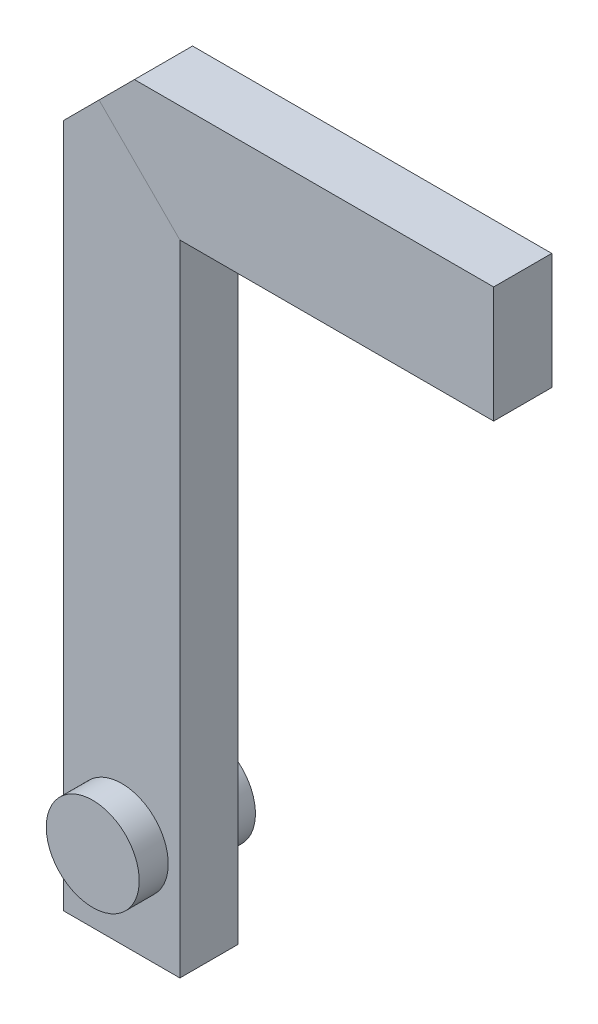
ISO-10303-21;
HEADER;
FILE_DESCRIPTION(('STEP AP214'),'2;1');
FILE_NAME('part.step','',(''),(''),'','','');
FILE_SCHEMA(('AUTOMOTIVE_DESIGN { 1 0 10303 214 1 1 1 1 }'));
ENDSEC;
DATA;
#1=APPLICATION_CONTEXT('core data for automotive mechanical design processes');
#2=APPLICATION_PROTOCOL_DEFINITION('international standard','automotive_design',2000,#1);
#3=PRODUCT_CONTEXT('',#1,'mechanical');
#4=PRODUCT('Part','Part','',(#3));
#5=PRODUCT_RELATED_PRODUCT_CATEGORY('part','',(#4));
#6=PRODUCT_DEFINITION_FORMATION('','',#4);
#7=PRODUCT_DEFINITION_CONTEXT('part definition',#1,'design');
#8=PRODUCT_DEFINITION('design','',#6,#7);
#9=PRODUCT_DEFINITION_SHAPE('','',#8);
#10=(LENGTH_UNIT() NAMED_UNIT(*) SI_UNIT(.MILLI.,.METRE.));
#11=(NAMED_UNIT(*) PLANE_ANGLE_UNIT() SI_UNIT($,.RADIAN.));
#12=(NAMED_UNIT(*) SI_UNIT($,.STERADIAN.) SOLID_ANGLE_UNIT());
#13=UNCERTAINTY_MEASURE_WITH_UNIT(LENGTH_MEASURE(1.E-05),#10,'distance_accuracy_value','');
#14=(GEOMETRIC_REPRESENTATION_CONTEXT(3) GLOBAL_UNCERTAINTY_ASSIGNED_CONTEXT((#13)) GLOBAL_UNIT_ASSIGNED_CONTEXT((#10,
#11,#12)) REPRESENTATION_CONTEXT('',''));
#15=CARTESIAN_POINT('',(0.,0.,0.));
#16=DIRECTION('',(0.,0.,1.));
#17=DIRECTION('',(1.,0.,0.));
#18=AXIS2_PLACEMENT_3D('',#15,#16,#17);
#19=CARTESIAN_POINT('',(20.32,0.,0.));
#20=DIRECTION('',(1.,0.,0.));
#21=DIRECTION('',(0.,0.,-1.));
#22=AXIS2_PLACEMENT_3D('',#19,#20,#21);
#23=PLANE('',#22);
#24=DIRECTION('',(0.,0.,1.));
#25=VECTOR('',#24,1.);
#26=CARTESIAN_POINT('',(20.32,41.275,-1.5875));
#27=LINE('',#26,#25);
#28=CARTESIAN_POINT('',(20.32,41.275,-1.5875));
#29=VERTEX_POINT('',#28);
#30=CARTESIAN_POINT('',(20.32,41.275,1.5875));
#31=VERTEX_POINT('',#30);
#32=EDGE_CURVE('E148',#29,#31,#27,.T.);
#33=ORIENTED_EDGE('',*,*,#32,.T.);
#34=DIRECTION('',(0.,-1.,0.));
#35=VECTOR('',#34,1.);
#36=CARTESIAN_POINT('',(20.32,34.925,1.5875));
#37=LINE('',#36,#35);
#38=CARTESIAN_POINT('',(20.32,34.925,1.5875));
#39=VERTEX_POINT('',#38);
#40=EDGE_CURVE('E145',#31,#39,#37,.T.);
#41=ORIENTED_EDGE('',*,*,#40,.T.);
#42=DIRECTION('',(0.,0.,-1.));
#43=VECTOR('',#42,1.);
#44=CARTESIAN_POINT('',(20.32,34.925,-1.5875));
#45=LINE('',#44,#43);
#46=CARTESIAN_POINT('',(20.32,34.925,-1.5875));
#47=VERTEX_POINT('',#46);
#48=EDGE_CURVE('E141',#39,#47,#45,.T.);
#49=ORIENTED_EDGE('',*,*,#48,.T.);
#50=DIRECTION('',(0.,1.,0.));
#51=VECTOR('',#50,1.);
#52=CARTESIAN_POINT('',(20.32,34.925,-1.5875));
#53=LINE('',#52,#51);
#54=EDGE_CURVE('E138',#47,#29,#53,.T.);
#55=ORIENTED_EDGE('',*,*,#54,.T.);
#56=EDGE_LOOP('',(#33,#41,#49,#55));
#57=FACE_BOUND('',#56,.T.);
#58=ADVANCED_FACE('F39',(#57),#23,.T.);
#59=CARTESIAN_POINT('',(38.1,0.,0.));
#60=DIRECTION('',(0.,1.,0.));
#61=DIRECTION('',(0.,0.,-1.));
#62=AXIS2_PLACEMENT_3D('',#59,#60,#61);
#63=PLANE('',#62);
#64=DIRECTION('',(0.,0.,1.));
#65=VECTOR('',#64,1.);
#66=CARTESIAN_POINT('',(-3.17500000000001,0.,-1.5875));
#67=LINE('',#66,#65);
#68=CARTESIAN_POINT('',(-3.17500000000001,0.,-1.5875));
#69=VERTEX_POINT('',#68);
#70=CARTESIAN_POINT('',(-3.17500000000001,0.,1.5875));
#71=VERTEX_POINT('',#70);
#72=EDGE_CURVE('E95',#69,#71,#67,.T.);
#73=ORIENTED_EDGE('',*,*,#72,.F.);
#74=DIRECTION('',(-1.,0.,0.));
#75=VECTOR('',#74,1.);
#76=CARTESIAN_POINT('',(3.17499999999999,0.,-1.5875));
#77=LINE('',#76,#75);
#78=CARTESIAN_POINT('',(3.17499999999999,0.,-1.5875));
#79=VERTEX_POINT('',#78);
#80=EDGE_CURVE('E103',#79,#69,#77,.T.);
#81=ORIENTED_EDGE('',*,*,#80,.F.);
#82=DIRECTION('',(0.,0.,-1.));
#83=VECTOR('',#82,1.);
#84=CARTESIAN_POINT('',(3.17499999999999,0.,-1.5875));
#85=LINE('',#84,#83);
#86=CARTESIAN_POINT('',(3.17499999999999,0.,1.5875));
#87=VERTEX_POINT('',#86);
#88=EDGE_CURVE('E106',#87,#79,#85,.T.);
#89=ORIENTED_EDGE('',*,*,#88,.F.);
#90=DIRECTION('',(1.,0.,0.));
#91=VECTOR('',#90,1.);
#92=CARTESIAN_POINT('',(3.17499999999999,0.,1.5875));
#93=LINE('',#92,#91);
#94=EDGE_CURVE('E124',#71,#87,#93,.T.);
#95=ORIENTED_EDGE('',*,*,#94,.F.);
#96=EDGE_LOOP('',(#73,#81,#89,#95));
#97=FACE_BOUND('',#96,.T.);
#98=ADVANCED_FACE('F105',(#97),#63,.F.);
#99=CARTESIAN_POINT('',(-3.5925,41.275,-1.5875));
#100=DIRECTION('',(0.,1.,0.));
#101=DIRECTION('',(0.,0.,1.));
#102=AXIS2_PLACEMENT_3D('',#99,#100,#101);
#103=PLANE('',#102);
#104=DIRECTION('',(0.,0.,1.));
#105=VECTOR('',#104,1.);
#106=CARTESIAN_POINT('',(0.690949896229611,41.275,-1.5875));
#107=LINE('',#106,#105);
#108=CARTESIAN_POINT('',(0.690949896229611,41.275,-1.5875));
#109=VERTEX_POINT('',#108);
#110=CARTESIAN_POINT('',(0.690949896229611,41.275,1.5875));
#111=VERTEX_POINT('',#110);
#112=EDGE_CURVE('E142',#109,#111,#107,.T.);
#113=ORIENTED_EDGE('',*,*,#112,.T.);
#114=DIRECTION('',(1.,0.,0.));
#115=VECTOR('',#114,1.);
#116=CARTESIAN_POINT('',(-3.5925,41.275,1.5875));
#117=LINE('',#116,#115);
#118=EDGE_CURVE('E159',#111,#31,#117,.T.);
#119=ORIENTED_EDGE('',*,*,#118,.T.);
#120=ORIENTED_EDGE('',*,*,#32,.F.);
#121=DIRECTION('',(1.,0.,0.));
#122=VECTOR('',#121,1.);
#123=CARTESIAN_POINT('',(-3.5925,41.275,-1.5875));
#124=LINE('',#123,#122);
#125=EDGE_CURVE('E86',#109,#29,#124,.T.);
#126=ORIENTED_EDGE('',*,*,#125,.F.);
#127=EDGE_LOOP('',(#113,#119,#120,#126));
#128=FACE_BOUND('',#127,.T.);
#129=ADVANCED_FACE('F246',(#128),#103,.T.);
#130=CARTESIAN_POINT('',(-3.5925,34.925,1.5875));
#131=DIRECTION('',(0.,0.,1.));
#132=DIRECTION('',(1.,0.,0.));
#133=AXIS2_PLACEMENT_3D('',#130,#131,#132);
#134=PLANE('',#133);
#135=DIRECTION('',(0.707106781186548,0.707106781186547,0.));
#136=VECTOR('',#135,1.);
#137=CARTESIAN_POINT('',(-20.2920250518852,20.2920250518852,1.5875));
#138=LINE('',#137,#136);
#139=CARTESIAN_POINT('',(-1.2420250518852,39.3420250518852,1.5875));
#140=VERTEX_POINT('',#139);
#141=EDGE_CURVE('E199',#140,#111,#138,.T.);
#142=ORIENTED_EDGE('',*,*,#141,.F.);
#143=DIRECTION('',(-0.707106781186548,0.707106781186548,0.));
#144=VECTOR('',#143,1.);
#145=CARTESIAN_POINT('',(20.6375,17.4625,1.5875));
#146=LINE('',#145,#144);
#147=CARTESIAN_POINT('',(3.175,34.925,1.5875));
#148=VERTEX_POINT('',#147);
#149=EDGE_CURVE('E11',#148,#140,#146,.T.);
#150=ORIENTED_EDGE('',*,*,#149,.F.);
#151=DIRECTION('',(1.,0.,0.));
#152=VECTOR('',#151,1.);
#153=CARTESIAN_POINT('',(-3.5925,34.925,1.5875));
#154=LINE('',#153,#152);
#155=EDGE_CURVE('E156',#148,#39,#154,.T.);
#156=ORIENTED_EDGE('',*,*,#155,.T.);
#157=ORIENTED_EDGE('',*,*,#40,.F.);
#158=ORIENTED_EDGE('',*,*,#118,.F.);
#159=EDGE_LOOP('',(#142,#150,#156,#157,#158));
#160=FACE_BOUND('',#159,.T.);
#161=ADVANCED_FACE('F249',(#160),#134,.T.);
#162=CARTESIAN_POINT('',(-3.5925,34.925,-1.5875));
#163=DIRECTION('',(0.,-1.,0.));
#164=DIRECTION('',(0.,0.,-1.));
#165=AXIS2_PLACEMENT_3D('',#162,#163,#164);
#166=PLANE('',#165);
#167=DIRECTION('',(0.,0.,1.));
#168=VECTOR('',#167,1.);
#169=CARTESIAN_POINT('',(3.17499999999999,34.925,-1.5875));
#170=LINE('',#169,#168);
#171=CARTESIAN_POINT('',(3.175,34.925,-1.5875));
#172=VERTEX_POINT('',#171);
#173=EDGE_CURVE('E48',#172,#148,#170,.T.);
#174=ORIENTED_EDGE('',*,*,#173,.F.);
#175=DIRECTION('',(1.,0.,0.));
#176=VECTOR('',#175,1.);
#177=CARTESIAN_POINT('',(-3.5925,34.925,-1.5875));
#178=LINE('',#177,#176);
#179=EDGE_CURVE('E152',#172,#47,#178,.T.);
#180=ORIENTED_EDGE('',*,*,#179,.T.);
#181=ORIENTED_EDGE('',*,*,#48,.F.);
#182=ORIENTED_EDGE('',*,*,#155,.F.);
#183=EDGE_LOOP('',(#174,#180,#181,#182));
#184=FACE_BOUND('',#183,.T.);
#185=ADVANCED_FACE('F253',(#184),#166,.T.);
#186=CARTESIAN_POINT('',(-3.5925,34.925,-1.5875));
#187=DIRECTION('',(0.,0.,-1.));
#188=DIRECTION('',(-1.,0.,0.));
#189=AXIS2_PLACEMENT_3D('',#186,#187,#188);
#190=PLANE('',#189);
#191=DIRECTION('',(0.707106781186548,0.707106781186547,0.));
#192=VECTOR('',#191,1.);
#193=CARTESIAN_POINT('',(-20.2920250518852,20.2920250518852,-1.5875));
#194=LINE('',#193,#192);
#195=CARTESIAN_POINT('',(-1.2420250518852,39.3420250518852,-1.5875));
#196=VERTEX_POINT('',#195);
#197=EDGE_CURVE('E185',#196,#109,#194,.T.);
#198=ORIENTED_EDGE('',*,*,#197,.T.);
#199=ORIENTED_EDGE('',*,*,#125,.T.);
#200=ORIENTED_EDGE('',*,*,#54,.F.);
#201=ORIENTED_EDGE('',*,*,#179,.F.);
#202=DIRECTION('',(0.707106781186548,-0.707106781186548,0.));
#203=VECTOR('',#202,1.);
#204=CARTESIAN_POINT('',(20.6375,17.4625,-1.5875));
#205=LINE('',#204,#203);
#206=EDGE_CURVE('E128',#196,#172,#205,.T.);
#207=ORIENTED_EDGE('',*,*,#206,.F.);
#208=EDGE_LOOP('',(#198,#199,#200,#201,#207));
#209=FACE_BOUND('',#208,.T.);
#210=ADVANCED_FACE('F244',(#209),#190,.T.);
#211=CARTESIAN_POINT('',(3.17499999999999,0.,-1.5875));
#212=DIRECTION('',(0.,0.,-1.));
#213=DIRECTION('',(-1.,0.,0.));
#214=AXIS2_PLACEMENT_3D('',#211,#212,#213);
#215=PLANE('',#214);
#216=CARTESIAN_POINT('',(0.,5.08,-1.5875));
#217=DIRECTION('',(0.,0.,-1.));
#218=DIRECTION('',(-1.,0.,0.));
#219=AXIS2_PLACEMENT_3D('',#216,#217,#218);
#220=CIRCLE('',#219,2.54);
#221=CARTESIAN_POINT('',(-2.54,5.08,-1.5875));
#222=VERTEX_POINT('',#221);
#223=EDGE_CURVE('E202',#222,#222,#220,.F.);
#224=ORIENTED_EDGE('',*,*,#223,.T.);
#225=EDGE_LOOP('',(#224));
#226=FACE_BOUND('',#225,.T.);
#227=CARTESIAN_POINT('',(-3.17500000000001,37.4090501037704,-1.5875));
#228=VERTEX_POINT('',#227);
#229=EDGE_CURVE('E56',#228,#196,#194,.T.);
#230=ORIENTED_EDGE('',*,*,#229,.T.);
#231=ORIENTED_EDGE('',*,*,#206,.T.);
#232=DIRECTION('',(0.,1.,0.));
#233=VECTOR('',#232,1.);
#234=CARTESIAN_POINT('',(3.17499999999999,0.,-1.5875));
#235=LINE('',#234,#233);
#236=EDGE_CURVE('E120',#79,#172,#235,.T.);
#237=ORIENTED_EDGE('',*,*,#236,.F.);
#238=ORIENTED_EDGE('',*,*,#80,.T.);
#239=DIRECTION('',(0.,1.,0.));
#240=VECTOR('',#239,1.);
#241=CARTESIAN_POINT('',(-3.17500000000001,0.,-1.5875));
#242=LINE('',#241,#240);
#243=EDGE_CURVE('E113',#69,#228,#242,.T.);
#244=ORIENTED_EDGE('',*,*,#243,.T.);
#245=EDGE_LOOP('',(#230,#231,#237,#238,#244));
#246=FACE_BOUND('',#245,.T.);
#247=ADVANCED_FACE('F126',(#226,#246),#215,.T.);
#248=CARTESIAN_POINT('',(3.17499999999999,0.,-1.5875));
#249=DIRECTION('',(1.,0.,0.));
#250=DIRECTION('',(0.,0.,-1.));
#251=AXIS2_PLACEMENT_3D('',#248,#249,#250);
#252=PLANE('',#251);
#253=ORIENTED_EDGE('',*,*,#236,.T.);
#254=ORIENTED_EDGE('',*,*,#173,.T.);
#255=DIRECTION('',(0.,1.,0.));
#256=VECTOR('',#255,1.);
#257=CARTESIAN_POINT('',(3.17499999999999,0.,1.5875));
#258=LINE('',#257,#256);
#259=EDGE_CURVE('E122',#87,#148,#258,.T.);
#260=ORIENTED_EDGE('',*,*,#259,.F.);
#261=ORIENTED_EDGE('',*,*,#88,.T.);
#262=EDGE_LOOP('',(#253,#254,#260,#261));
#263=FACE_BOUND('',#262,.T.);
#264=ADVANCED_FACE('F118',(#263),#252,.T.);
#265=CARTESIAN_POINT('',(3.17499999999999,0.,1.5875));
#266=DIRECTION('',(0.,0.,1.));
#267=DIRECTION('',(1.,0.,0.));
#268=AXIS2_PLACEMENT_3D('',#265,#266,#267);
#269=PLANE('',#268);
#270=CARTESIAN_POINT('',(0.,5.08,1.5875));
#271=DIRECTION('',(0.,0.,1.));
#272=DIRECTION('',(1.,0.,0.));
#273=AXIS2_PLACEMENT_3D('',#270,#271,#272);
#274=CIRCLE('',#273,2.54);
#275=CARTESIAN_POINT('',(-2.54,5.08,1.5875));
#276=VERTEX_POINT('',#275);
#277=EDGE_CURVE('E42',#276,#276,#274,.F.);
#278=ORIENTED_EDGE('',*,*,#277,.T.);
#279=EDGE_LOOP('',(#278));
#280=FACE_BOUND('',#279,.T.);
#281=CARTESIAN_POINT('',(-3.17500000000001,37.4090501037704,1.5875));
#282=VERTEX_POINT('',#281);
#283=EDGE_CURVE('E194',#282,#140,#138,.T.);
#284=ORIENTED_EDGE('',*,*,#283,.F.);
#285=DIRECTION('',(0.,1.,0.));
#286=VECTOR('',#285,1.);
#287=CARTESIAN_POINT('',(-3.17500000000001,0.,1.5875));
#288=LINE('',#287,#286);
#289=EDGE_CURVE('E135',#71,#282,#288,.T.);
#290=ORIENTED_EDGE('',*,*,#289,.F.);
#291=ORIENTED_EDGE('',*,*,#94,.T.);
#292=ORIENTED_EDGE('',*,*,#259,.T.);
#293=ORIENTED_EDGE('',*,*,#149,.T.);
#294=EDGE_LOOP('',(#284,#290,#291,#292,#293));
#295=FACE_BOUND('',#294,.T.);
#296=ADVANCED_FACE('F192',(#280,#295),#269,.T.);
#297=CARTESIAN_POINT('',(-3.17500000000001,0.,-1.5875));
#298=DIRECTION('',(-1.,0.,0.));
#299=DIRECTION('',(0.,0.,1.));
#300=AXIS2_PLACEMENT_3D('',#297,#298,#299);
#301=PLANE('',#300);
#302=DIRECTION('',(0.,0.,1.));
#303=VECTOR('',#302,1.);
#304=CARTESIAN_POINT('',(-3.17500000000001,37.4090501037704,-1.5875));
#305=LINE('',#304,#303);
#306=EDGE_CURVE('E175',#228,#282,#305,.T.);
#307=ORIENTED_EDGE('',*,*,#306,.F.);
#308=ORIENTED_EDGE('',*,*,#243,.F.);
#309=ORIENTED_EDGE('',*,*,#72,.T.);
#310=ORIENTED_EDGE('',*,*,#289,.T.);
#311=EDGE_LOOP('',(#307,#308,#309,#310));
#312=FACE_BOUND('',#311,.T.);
#313=ADVANCED_FACE('F174',(#312),#301,.T.);
#314=CARTESIAN_POINT('',(-20.2920250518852,20.2920250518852,-1.5875));
#315=DIRECTION('',(0.707106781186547,-0.707106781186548,0.));
#316=DIRECTION('',(0.707106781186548,0.707106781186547,0.));
#317=AXIS2_PLACEMENT_3D('',#314,#315,#316);
#318=PLANE('',#317);
#319=ORIENTED_EDGE('',*,*,#283,.T.);
#320=ORIENTED_EDGE('',*,*,#141,.T.);
#321=ORIENTED_EDGE('',*,*,#112,.F.);
#322=ORIENTED_EDGE('',*,*,#197,.F.);
#323=ORIENTED_EDGE('',*,*,#229,.F.);
#324=ORIENTED_EDGE('',*,*,#306,.T.);
#325=EDGE_LOOP('',(#319,#320,#321,#322,#323,#324));
#326=FACE_BOUND('',#325,.T.);
#327=ADVANCED_FACE('F229',(#326),#318,.F.);
#328=CARTESIAN_POINT('',(0.,0.,3.175));
#329=DIRECTION('',(0.,0.,1.));
#330=DIRECTION('',(1.,0.,0.));
#331=AXIS2_PLACEMENT_3D('',#328,#329,#330);
#332=PLANE('',#331);
#333=CARTESIAN_POINT('',(0.,5.08,3.175));
#334=DIRECTION('',(0.,0.,1.));
#335=DIRECTION('',(1.,0.,0.));
#336=AXIS2_PLACEMENT_3D('',#333,#334,#335);
#337=CIRCLE('',#336,2.54);
#338=CARTESIAN_POINT('',(-2.54,5.08,3.175));
#339=VERTEX_POINT('',#338);
#340=EDGE_CURVE('E207',#339,#339,#337,.T.);
#341=ORIENTED_EDGE('',*,*,#340,.T.);
#342=EDGE_LOOP('',(#341));
#343=FACE_BOUND('',#342,.T.);
#344=ADVANCED_FACE('F235',(#343),#332,.T.);
#345=CARTESIAN_POINT('',(0.,5.08,3.175));
#346=DIRECTION('',(0.,0.,-1.));
#347=DIRECTION('',(-1.,0.,0.));
#348=AXIS2_PLACEMENT_3D('',#345,#346,#347);
#349=CYLINDRICAL_SURFACE('',#348,2.54);
#350=CARTESIAN_POINT('',(-2.54,5.08,1.5875));
#351=CARTESIAN_POINT('',(-2.54,5.08,1.60403645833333));
#352=CARTESIAN_POINT('',(-2.54,5.08,1.62057291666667));
#353=CARTESIAN_POINT('',(-2.54,5.08,1.65364583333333));
#354=CARTESIAN_POINT('',(-2.54,5.08,1.67018229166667));
#355=CARTESIAN_POINT('',(-2.54,5.08,1.70325520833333));
#356=CARTESIAN_POINT('',(-2.54,5.08,1.71979166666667));
#357=CARTESIAN_POINT('',(-2.54,5.08,1.75286458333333));
#358=CARTESIAN_POINT('',(-2.54,5.08,1.76940104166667));
#359=CARTESIAN_POINT('',(-2.54,5.08,1.80247395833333));
#360=CARTESIAN_POINT('',(-2.54,5.08,1.81901041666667));
#361=CARTESIAN_POINT('',(-2.54,5.08,1.85208333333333));
#362=CARTESIAN_POINT('',(-2.54,5.08,1.86861979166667));
#363=CARTESIAN_POINT('',(-2.54,5.08,1.90169270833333));
#364=CARTESIAN_POINT('',(-2.54,5.08,1.91822916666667));
#365=CARTESIAN_POINT('',(-2.54,5.08,1.95130208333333));
#366=CARTESIAN_POINT('',(-2.54,5.08,1.96783854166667));
#367=CARTESIAN_POINT('',(-2.54,5.08,2.00091145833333));
#368=CARTESIAN_POINT('',(-2.54,5.08,2.01744791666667));
#369=CARTESIAN_POINT('',(-2.54,5.08,2.05052083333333));
#370=CARTESIAN_POINT('',(-2.54,5.08,2.06705729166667));
#371=CARTESIAN_POINT('',(-2.54,5.08,2.10013020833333));
#372=CARTESIAN_POINT('',(-2.54,5.08,2.11666666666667));
#373=CARTESIAN_POINT('',(-2.54,5.08,2.14973958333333));
#374=CARTESIAN_POINT('',(-2.54,5.08,2.16627604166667));
#375=CARTESIAN_POINT('',(-2.54,5.08,2.19934895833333));
#376=CARTESIAN_POINT('',(-2.54,5.08,2.21588541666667));
#377=CARTESIAN_POINT('',(-2.54,5.08,2.24895833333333));
#378=CARTESIAN_POINT('',(-2.54,5.08,2.26549479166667));
#379=CARTESIAN_POINT('',(-2.54,5.08,2.29856770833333));
#380=CARTESIAN_POINT('',(-2.54,5.08,2.31510416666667));
#381=CARTESIAN_POINT('',(-2.54,5.08,2.34817708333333));
#382=CARTESIAN_POINT('',(-2.54,5.08,2.36471354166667));
#383=CARTESIAN_POINT('',(-2.54,5.08,2.39778645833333));
#384=CARTESIAN_POINT('',(-2.54,5.08,2.41432291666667));
#385=CARTESIAN_POINT('',(-2.54,5.08,2.44739583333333));
#386=CARTESIAN_POINT('',(-2.54,5.08,2.46393229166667));
#387=CARTESIAN_POINT('',(-2.54,5.08,2.49700520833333));
#388=CARTESIAN_POINT('',(-2.54,5.08,2.51354166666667));
#389=CARTESIAN_POINT('',(-2.54,5.08,2.54661458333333));
#390=CARTESIAN_POINT('',(-2.54,5.08,2.56315104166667));
#391=CARTESIAN_POINT('',(-2.54,5.08,2.59622395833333));
#392=CARTESIAN_POINT('',(-2.54,5.08,2.61276041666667));
#393=CARTESIAN_POINT('',(-2.54,5.08,2.64583333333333));
#394=CARTESIAN_POINT('',(-2.54,5.08,2.66236979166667));
#395=CARTESIAN_POINT('',(-2.54,5.08,2.69544270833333));
#396=CARTESIAN_POINT('',(-2.54,5.08,2.71197916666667));
#397=CARTESIAN_POINT('',(-2.54,5.08,2.74505208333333));
#398=CARTESIAN_POINT('',(-2.54,5.08,2.76158854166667));
#399=CARTESIAN_POINT('',(-2.54,5.08,2.79466145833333));
#400=CARTESIAN_POINT('',(-2.54,5.08,2.81119791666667));
#401=CARTESIAN_POINT('',(-2.54,5.08,2.84427083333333));
#402=CARTESIAN_POINT('',(-2.54,5.08,2.86080729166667));
#403=CARTESIAN_POINT('',(-2.54,5.08,2.89388020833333));
#404=CARTESIAN_POINT('',(-2.54,5.08,2.91041666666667));
#405=CARTESIAN_POINT('',(-2.54,5.08,2.94348958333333));
#406=CARTESIAN_POINT('',(-2.54,5.08,2.96002604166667));
#407=CARTESIAN_POINT('',(-2.54,5.08,2.99309895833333));
#408=CARTESIAN_POINT('',(-2.54,5.08,3.00963541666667));
#409=CARTESIAN_POINT('',(-2.54,5.08,3.04270833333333));
#410=CARTESIAN_POINT('',(-2.54,5.08,3.05924479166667));
#411=CARTESIAN_POINT('',(-2.54,5.08,3.09231770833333));
#412=CARTESIAN_POINT('',(-2.54,5.08,3.10885416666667));
#413=CARTESIAN_POINT('',(-2.54,5.08,3.14192708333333));
#414=CARTESIAN_POINT('',(-2.54,5.08,3.15846354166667));
#415=CARTESIAN_POINT('',(-2.54,5.08,3.175));
#416=B_SPLINE_CURVE_WITH_KNOTS('',3,(#350,#351,#352,#353,#354,#355,#356,#357,#358,#359,#360,
#361,#362,#363,#364,#365,#366,#367,#368,#369,#370,#371,#372,#373,#374,#375,#376,#377,#378,#379,
#380,#381,#382,#383,#384,#385,#386,#387,#388,#389,#390,#391,#392,#393,#394,#395,#396,#397,#398,
#399,#400,#401,#402,#403,#404,#405,#406,#407,#408,#409,#410,#411,#412,#413,#414,#415),
.UNSPECIFIED.,.F.,.F.,(4,2,2,2,2,2,2,2,2,2,2,2,2,2,2,2,2,2,2,2,2,2,2,2,2,2,2,2,2,2,2,2,4),(0.,
0.049609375,0.0992187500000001,0.148828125,0.1984375,0.248046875,0.29765625,0.347265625,
0.396875,0.446484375,0.49609375,0.545703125,0.595312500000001,0.644921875,0.69453125,
0.744140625,0.79375,0.843359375,0.89296875,0.942578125,0.9921875,1.041796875,1.09140625,
1.141015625,1.190625,1.240234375,1.28984375,1.339453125,1.3890625,1.438671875,1.48828125,
1.537890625,1.5875),.UNSPECIFIED.);
#417=EDGE_CURVE('BSEAM224',#276,#339,#416,.T.);
#418=ORIENTED_EDGE('',*,*,#277,.F.);
#419=ORIENTED_EDGE('',*,*,#340,.F.);
#420=ORIENTED_EDGE('',*,*,#417,.T.);
#421=ORIENTED_EDGE('',*,*,#417,.F.);
#422=EDGE_LOOP('',(#418,#420,#419,#421));
#423=FACE_BOUND('',#422,.T.);
#424=ADVANCED_FACE('F224',(#423),#349,.T.);
#425=CARTESIAN_POINT('',(0.,5.08,-3.175));
#426=DIRECTION('',(0.,0.,1.));
#427=DIRECTION('',(1.,0.,0.));
#428=AXIS2_PLACEMENT_3D('',#425,#426,#427);
#429=CIRCLE('',#428,2.54);
#430=CARTESIAN_POINT('',(-2.54,5.08,-3.175));
#431=VERTEX_POINT('',#430);
#432=EDGE_CURVE('E211',#431,#431,#429,.T.);
#433=CARTESIAN_POINT('',(-2.54,5.08,-1.5875));
#434=CARTESIAN_POINT('',(-2.54,5.08,-1.60403645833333));
#435=CARTESIAN_POINT('',(-2.54,5.08,-1.62057291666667));
#436=CARTESIAN_POINT('',(-2.54,5.08,-1.65364583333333));
#437=CARTESIAN_POINT('',(-2.54,5.08,-1.67018229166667));
#438=CARTESIAN_POINT('',(-2.54,5.08,-1.70325520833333));
#439=CARTESIAN_POINT('',(-2.54,5.08,-1.71979166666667));
#440=CARTESIAN_POINT('',(-2.54,5.08,-1.75286458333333));
#441=CARTESIAN_POINT('',(-2.54,5.08,-1.76940104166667));
#442=CARTESIAN_POINT('',(-2.54,5.08,-1.80247395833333));
#443=CARTESIAN_POINT('',(-2.54,5.08,-1.81901041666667));
#444=CARTESIAN_POINT('',(-2.54,5.08,-1.85208333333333));
#445=CARTESIAN_POINT('',(-2.54,5.08,-1.86861979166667));
#446=CARTESIAN_POINT('',(-2.54,5.08,-1.90169270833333));
#447=CARTESIAN_POINT('',(-2.54,5.08,-1.91822916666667));
#448=CARTESIAN_POINT('',(-2.54,5.08,-1.95130208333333));
#449=CARTESIAN_POINT('',(-2.54,5.08,-1.96783854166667));
#450=CARTESIAN_POINT('',(-2.54,5.08,-2.00091145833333));
#451=CARTESIAN_POINT('',(-2.54,5.08,-2.01744791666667));
#452=CARTESIAN_POINT('',(-2.54,5.08,-2.05052083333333));
#453=CARTESIAN_POINT('',(-2.54,5.08,-2.06705729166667));
#454=CARTESIAN_POINT('',(-2.54,5.08,-2.10013020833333));
#455=CARTESIAN_POINT('',(-2.54,5.08,-2.11666666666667));
#456=CARTESIAN_POINT('',(-2.54,5.08,-2.14973958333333));
#457=CARTESIAN_POINT('',(-2.54,5.08,-2.16627604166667));
#458=CARTESIAN_POINT('',(-2.54,5.08,-2.19934895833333));
#459=CARTESIAN_POINT('',(-2.54,5.08,-2.21588541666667));
#460=CARTESIAN_POINT('',(-2.54,5.08,-2.24895833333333));
#461=CARTESIAN_POINT('',(-2.54,5.08,-2.26549479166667));
#462=CARTESIAN_POINT('',(-2.54,5.08,-2.29856770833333));
#463=CARTESIAN_POINT('',(-2.54,5.08,-2.31510416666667));
#464=CARTESIAN_POINT('',(-2.54,5.08,-2.34817708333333));
#465=CARTESIAN_POINT('',(-2.54,5.08,-2.36471354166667));
#466=CARTESIAN_POINT('',(-2.54,5.08,-2.39778645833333));
#467=CARTESIAN_POINT('',(-2.54,5.08,-2.41432291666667));
#468=CARTESIAN_POINT('',(-2.54,5.08,-2.44739583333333));
#469=CARTESIAN_POINT('',(-2.54,5.08,-2.46393229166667));
#470=CARTESIAN_POINT('',(-2.54,5.08,-2.49700520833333));
#471=CARTESIAN_POINT('',(-2.54,5.08,-2.51354166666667));
#472=CARTESIAN_POINT('',(-2.54,5.08,-2.54661458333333));
#473=CARTESIAN_POINT('',(-2.54,5.08,-2.56315104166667));
#474=CARTESIAN_POINT('',(-2.54,5.08,-2.59622395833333));
#475=CARTESIAN_POINT('',(-2.54,5.08,-2.61276041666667));
#476=CARTESIAN_POINT('',(-2.54,5.08,-2.64583333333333));
#477=CARTESIAN_POINT('',(-2.54,5.08,-2.66236979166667));
#478=CARTESIAN_POINT('',(-2.54,5.08,-2.69544270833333));
#479=CARTESIAN_POINT('',(-2.54,5.08,-2.71197916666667));
#480=CARTESIAN_POINT('',(-2.54,5.08,-2.74505208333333));
#481=CARTESIAN_POINT('',(-2.54,5.08,-2.76158854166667));
#482=CARTESIAN_POINT('',(-2.54,5.08,-2.79466145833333));
#483=CARTESIAN_POINT('',(-2.54,5.08,-2.81119791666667));
#484=CARTESIAN_POINT('',(-2.54,5.08,-2.84427083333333));
#485=CARTESIAN_POINT('',(-2.54,5.08,-2.86080729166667));
#486=CARTESIAN_POINT('',(-2.54,5.08,-2.89388020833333));
#487=CARTESIAN_POINT('',(-2.54,5.08,-2.91041666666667));
#488=CARTESIAN_POINT('',(-2.54,5.08,-2.94348958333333));
#489=CARTESIAN_POINT('',(-2.54,5.08,-2.96002604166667));
#490=CARTESIAN_POINT('',(-2.54,5.08,-2.99309895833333));
#491=CARTESIAN_POINT('',(-2.54,5.08,-3.00963541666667));
#492=CARTESIAN_POINT('',(-2.54,5.08,-3.04270833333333));
#493=CARTESIAN_POINT('',(-2.54,5.08,-3.05924479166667));
#494=CARTESIAN_POINT('',(-2.54,5.08,-3.09231770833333));
#495=CARTESIAN_POINT('',(-2.54,5.08,-3.10885416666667));
#496=CARTESIAN_POINT('',(-2.54,5.08,-3.14192708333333));
#497=CARTESIAN_POINT('',(-2.54,5.08,-3.15846354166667));
#498=CARTESIAN_POINT('',(-2.54,5.08,-3.175));
#499=B_SPLINE_CURVE_WITH_KNOTS('',3,(#433,#434,#435,#436,#437,#438,#439,#440,#441,#442,#443,
#444,#445,#446,#447,#448,#449,#450,#451,#452,#453,#454,#455,#456,#457,#458,#459,#460,#461,#462,
#463,#464,#465,#466,#467,#468,#469,#470,#471,#472,#473,#474,#475,#476,#477,#478,#479,#480,#481,
#482,#483,#484,#485,#486,#487,#488,#489,#490,#491,#492,#493,#494,#495,#496,#497,#498),
.UNSPECIFIED.,.F.,.F.,(4,2,2,2,2,2,2,2,2,2,2,2,2,2,2,2,2,2,2,2,2,2,2,2,2,2,2,2,2,2,2,2,4),(0.,
0.0496093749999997,0.0992187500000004,0.148828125,0.1984375,0.248046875,0.29765625,0.347265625,
0.396875,0.446484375,0.49609375,0.545703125,0.5953125,0.644921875,0.69453125,0.744140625,
0.79375,0.843359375,0.892968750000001,0.942578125,0.9921875,1.041796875,1.09140625,1.141015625,
1.190625,1.240234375,1.28984375,1.339453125,1.3890625,1.438671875,1.48828125,1.537890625,
1.5875),.UNSPECIFIED.);
#500=EDGE_CURVE('BSEAM216',#222,#431,#499,.T.);
#501=ORIENTED_EDGE('',*,*,#223,.F.);
#502=ORIENTED_EDGE('',*,*,#432,.T.);
#503=ORIENTED_EDGE('',*,*,#500,.T.);
#504=ORIENTED_EDGE('',*,*,#500,.F.);
#505=EDGE_LOOP('',(#501,#503,#502,#504));
#506=FACE_BOUND('',#505,.T.);
#507=ADVANCED_FACE('F216',(#506),#349,.T.);
#508=CARTESIAN_POINT('',(0.,0.,-3.175));
#509=DIRECTION('',(0.,0.,1.));
#510=DIRECTION('',(1.,0.,0.));
#511=AXIS2_PLACEMENT_3D('',#508,#509,#510);
#512=PLANE('',#511);
#513=ORIENTED_EDGE('',*,*,#432,.F.);
#514=EDGE_LOOP('',(#513));
#515=FACE_BOUND('',#514,.T.);
#516=ADVANCED_FACE('F218',(#515),#512,.F.);
#517=CLOSED_SHELL('',(#58,#98,#129,#161,#185,#210,#247,#264,#296,#313,#327,#344,#424,#507,#516));
#518=MANIFOLD_SOLID_BREP('B2',#517);
#519=ADVANCED_BREP_SHAPE_REPRESENTATION('',(#18,#518),#14);
#520=SHAPE_DEFINITION_REPRESENTATION(#9,#519);
ENDSEC;
END-ISO-10303-21;
